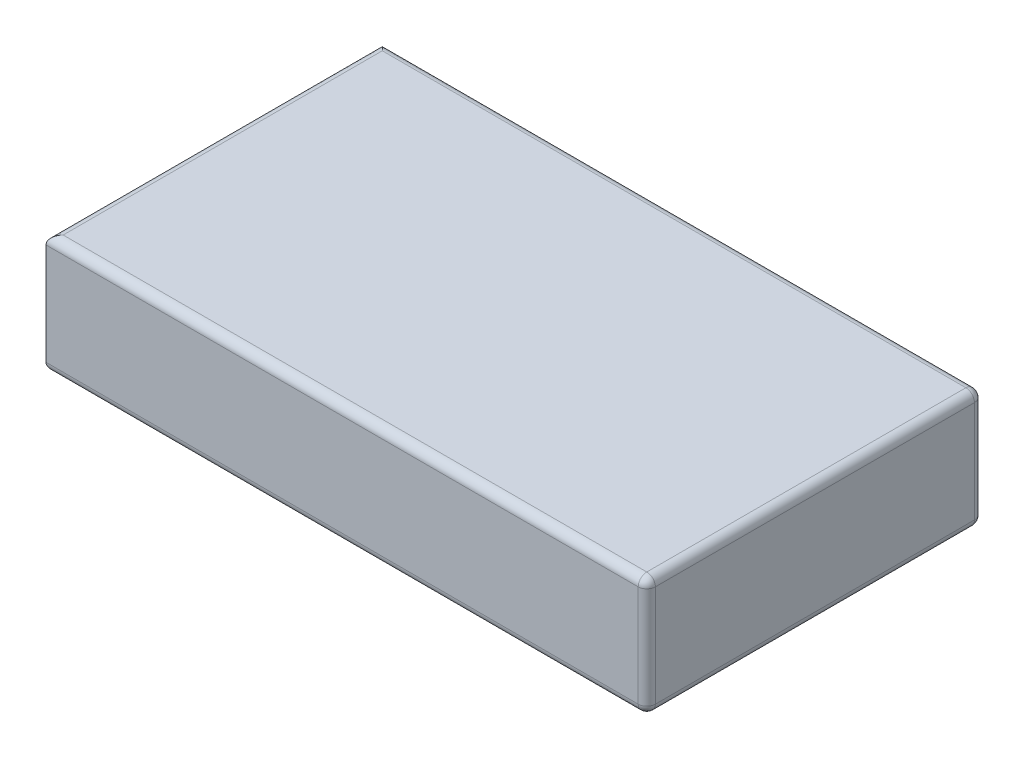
from build123d import *

# Parameters (mm, degrees)
SKETCH1_W           = 19.59
SKETCH1_H           = 6.92
BOSS_EXTRUDE1_DEPTH = 35
SKETCH3_R           = 2.16
CUT_EXTRUDE3_DEPTH  = 12
FILLET1_R           = 0.5


with BuildPart() as part:
    # Sketch1 → Boss-Extrude1 (new body)
    with BuildSketch(Plane(origin=(0, 0, 0), x_dir=(0, 0, -1), z_dir=(1, 0, 0))):
        Rectangle(SKETCH1_W, SKETCH1_H)
    extrude(amount=BOSS_EXTRUDE1_DEPTH)

    # Sketch3 → Cut-Extrude3 (cut)
    with BuildSketch(Plane.ZY):
        with Locations((-5.858, 0)):
            Circle(SKETCH3_R)
        with Locations((5.858, 0)):
            Circle(SKETCH3_R)
    extrude(amount=-CUT_EXTRUDE3_DEPTH, mode=Mode.SUBTRACT)

    # Fillet1
    fillet1_edges = [part.edges().sort_by_distance(p)[0] for p in [
        (35, 0, 9.795),
        (35, -3.46, 0),
        (35, 0, -9.795),
        (0, -3.46, 0),
        (0, 3.46, 0),
        (35, 3.46, 0),
        (17.5, -3.46, -9.795),
        (17.5, -3.46, 9.795),
        (17.5, 3.46, 9.795),
        (17.5, 3.46, -9.795),
    ]]
    fillet(fillet1_edges, radius=FILLET1_R)


solid = part.part
